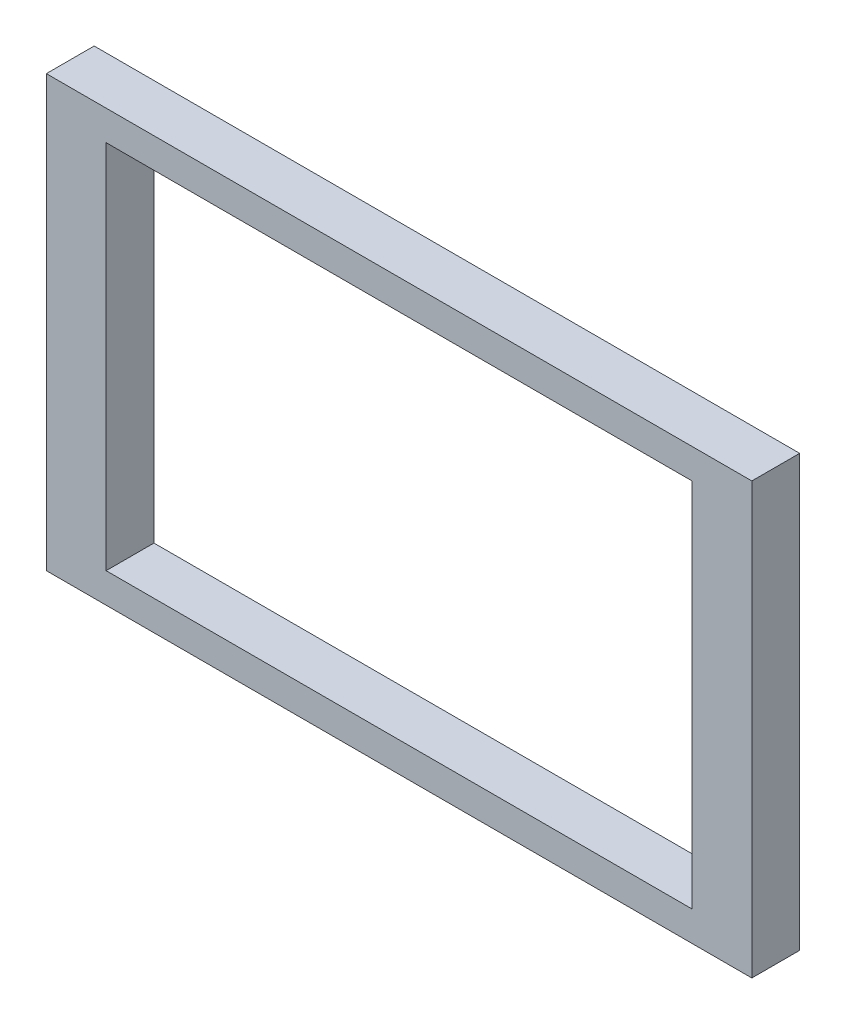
ISO-10303-21;
HEADER;
FILE_DESCRIPTION(('STEP AP214'),'2;1');
FILE_NAME('part.step','',(''),(''),'','','');
FILE_SCHEMA(('AUTOMOTIVE_DESIGN { 1 0 10303 214 1 1 1 1 }'));
ENDSEC;
DATA;
#1=APPLICATION_CONTEXT('core data for automotive mechanical design processes');
#2=APPLICATION_PROTOCOL_DEFINITION('international standard','automotive_design',2000,#1);
#3=PRODUCT_CONTEXT('',#1,'mechanical');
#4=PRODUCT('Part','Part','',(#3));
#5=PRODUCT_RELATED_PRODUCT_CATEGORY('part','',(#4));
#6=PRODUCT_DEFINITION_FORMATION('','',#4);
#7=PRODUCT_DEFINITION_CONTEXT('part definition',#1,'design');
#8=PRODUCT_DEFINITION('design','',#6,#7);
#9=PRODUCT_DEFINITION_SHAPE('','',#8);
#10=(LENGTH_UNIT() NAMED_UNIT(*) SI_UNIT(.MILLI.,.METRE.));
#11=(NAMED_UNIT(*) PLANE_ANGLE_UNIT() SI_UNIT($,.RADIAN.));
#12=(NAMED_UNIT(*) SI_UNIT($,.STERADIAN.) SOLID_ANGLE_UNIT());
#13=UNCERTAINTY_MEASURE_WITH_UNIT(LENGTH_MEASURE(1.E-05),#10,'distance_accuracy_value','');
#14=(GEOMETRIC_REPRESENTATION_CONTEXT(3) GLOBAL_UNCERTAINTY_ASSIGNED_CONTEXT((#13)) GLOBAL_UNIT_ASSIGNED_CONTEXT((#10,
#11,#12)) REPRESENTATION_CONTEXT('',''));
#15=CARTESIAN_POINT('',(0.,0.,0.));
#16=DIRECTION('',(0.,0.,1.));
#17=DIRECTION('',(1.,0.,0.));
#18=AXIS2_PLACEMENT_3D('',#15,#16,#17);
#19=CARTESIAN_POINT('',(0.,0.,4.));
#20=DIRECTION('',(1.,0.,0.));
#21=DIRECTION('',(0.,0.,-1.));
#22=AXIS2_PLACEMENT_3D('',#19,#20,#21);
#23=PLANE('',#22);
#24=DIRECTION('',(0.,-1.,0.));
#25=VECTOR('',#24,1.);
#26=CARTESIAN_POINT('',(0.,0.,0.));
#27=LINE('',#26,#25);
#28=CARTESIAN_POINT('',(0.,36.,0.));
#29=VERTEX_POINT('',#28);
#30=CARTESIAN_POINT('',(0.,0.,0.));
#31=VERTEX_POINT('',#30);
#32=EDGE_CURVE('E102',#29,#31,#27,.T.);
#33=ORIENTED_EDGE('',*,*,#32,.T.);
#34=DIRECTION('',(0.,0.,-1.));
#35=VECTOR('',#34,1.);
#36=CARTESIAN_POINT('',(0.,0.,4.));
#37=LINE('',#36,#35);
#38=CARTESIAN_POINT('',(0.,0.,4.));
#39=VERTEX_POINT('',#38);
#40=EDGE_CURVE('E11',#39,#31,#37,.T.);
#41=ORIENTED_EDGE('',*,*,#40,.F.);
#42=DIRECTION('',(0.,-1.,0.));
#43=VECTOR('',#42,1.);
#44=CARTESIAN_POINT('',(0.,0.,4.));
#45=LINE('',#44,#43);
#46=CARTESIAN_POINT('',(0.,36.,4.));
#47=VERTEX_POINT('',#46);
#48=EDGE_CURVE('E139',#47,#39,#45,.T.);
#49=ORIENTED_EDGE('',*,*,#48,.F.);
#50=DIRECTION('',(0.,0.,-1.));
#51=VECTOR('',#50,1.);
#52=CARTESIAN_POINT('',(0.,36.,4.));
#53=LINE('',#52,#51);
#54=EDGE_CURVE('E148',#47,#29,#53,.T.);
#55=ORIENTED_EDGE('',*,*,#54,.T.);
#56=EDGE_LOOP('',(#33,#41,#49,#55));
#57=FACE_BOUND('',#56,.T.);
#58=ADVANCED_FACE('F32',(#57),#23,.F.);
#59=CARTESIAN_POINT('',(0.,0.,4.));
#60=DIRECTION('',(0.,1.,0.));
#61=DIRECTION('',(0.,0.,1.));
#62=AXIS2_PLACEMENT_3D('',#59,#60,#61);
#63=PLANE('',#62);
#64=DIRECTION('',(1.,0.,0.));
#65=VECTOR('',#64,1.);
#66=CARTESIAN_POINT('',(0.,0.,0.));
#67=LINE('',#66,#65);
#68=CARTESIAN_POINT('',(59.,0.,0.));
#69=VERTEX_POINT('',#68);
#70=EDGE_CURVE('E133',#31,#69,#67,.T.);
#71=ORIENTED_EDGE('',*,*,#70,.T.);
#72=DIRECTION('',(0.,0.,-1.));
#73=VECTOR('',#72,1.);
#74=CARTESIAN_POINT('',(59.,0.,4.));
#75=LINE('',#74,#73);
#76=CARTESIAN_POINT('',(59.,0.,4.));
#77=VERTEX_POINT('',#76);
#78=EDGE_CURVE('E39',#77,#69,#75,.T.);
#79=ORIENTED_EDGE('',*,*,#78,.F.);
#80=DIRECTION('',(1.,0.,0.));
#81=VECTOR('',#80,1.);
#82=CARTESIAN_POINT('',(0.,0.,4.));
#83=LINE('',#82,#81);
#84=EDGE_CURVE('E142',#39,#77,#83,.T.);
#85=ORIENTED_EDGE('',*,*,#84,.F.);
#86=ORIENTED_EDGE('',*,*,#40,.T.);
#87=EDGE_LOOP('',(#71,#79,#85,#86));
#88=FACE_BOUND('',#87,.T.);
#89=ADVANCED_FACE('F172',(#88),#63,.F.);
#90=CARTESIAN_POINT('',(59.,0.,4.));
#91=DIRECTION('',(-1.,0.,0.));
#92=DIRECTION('',(0.,0.,1.));
#93=AXIS2_PLACEMENT_3D('',#90,#91,#92);
#94=PLANE('',#93);
#95=DIRECTION('',(0.,1.,0.));
#96=VECTOR('',#95,1.);
#97=CARTESIAN_POINT('',(59.,0.,0.));
#98=LINE('',#97,#96);
#99=CARTESIAN_POINT('',(59.,36.,0.));
#100=VERTEX_POINT('',#99);
#101=EDGE_CURVE('E135',#69,#100,#98,.T.);
#102=ORIENTED_EDGE('',*,*,#101,.T.);
#103=DIRECTION('',(0.,0.,-1.));
#104=VECTOR('',#103,1.);
#105=CARTESIAN_POINT('',(59.,36.,4.));
#106=LINE('',#105,#104);
#107=CARTESIAN_POINT('',(59.,36.,4.));
#108=VERTEX_POINT('',#107);
#109=EDGE_CURVE('E151',#108,#100,#106,.T.);
#110=ORIENTED_EDGE('',*,*,#109,.F.);
#111=DIRECTION('',(0.,1.,0.));
#112=VECTOR('',#111,1.);
#113=CARTESIAN_POINT('',(59.,0.,4.));
#114=LINE('',#113,#112);
#115=EDGE_CURVE('E144',#77,#108,#114,.T.);
#116=ORIENTED_EDGE('',*,*,#115,.F.);
#117=ORIENTED_EDGE('',*,*,#78,.T.);
#118=EDGE_LOOP('',(#102,#110,#116,#117));
#119=FACE_BOUND('',#118,.T.);
#120=ADVANCED_FACE('F158',(#119),#94,.F.);
#121=CARTESIAN_POINT('',(0.,36.,4.));
#122=DIRECTION('',(0.,-1.,0.));
#123=DIRECTION('',(0.,0.,-1.));
#124=AXIS2_PLACEMENT_3D('',#121,#122,#123);
#125=PLANE('',#124);
#126=DIRECTION('',(-1.,0.,0.));
#127=VECTOR('',#126,1.);
#128=CARTESIAN_POINT('',(0.,36.,0.));
#129=LINE('',#128,#127);
#130=EDGE_CURVE('E137',#100,#29,#129,.T.);
#131=ORIENTED_EDGE('',*,*,#130,.T.);
#132=ORIENTED_EDGE('',*,*,#54,.F.);
#133=DIRECTION('',(-1.,0.,0.));
#134=VECTOR('',#133,1.);
#135=CARTESIAN_POINT('',(0.,36.,4.));
#136=LINE('',#135,#134);
#137=EDGE_CURVE('E146',#108,#47,#136,.T.);
#138=ORIENTED_EDGE('',*,*,#137,.F.);
#139=ORIENTED_EDGE('',*,*,#109,.T.);
#140=EDGE_LOOP('',(#131,#132,#138,#139));
#141=FACE_BOUND('',#140,.T.);
#142=ADVANCED_FACE('F165',(#141),#125,.F.);
#143=CARTESIAN_POINT('',(0.,36.,4.));
#144=DIRECTION('',(0.,0.,-1.));
#145=DIRECTION('',(-1.,0.,0.));
#146=AXIS2_PLACEMENT_3D('',#143,#144,#145);
#147=PLANE('',#146);
#148=DIRECTION('',(1.,0.,0.));
#149=VECTOR('',#148,1.);
#150=CARTESIAN_POINT('',(5.,2.5,4.));
#151=LINE('',#150,#149);
#152=CARTESIAN_POINT('',(5.,2.5,4.));
#153=VERTEX_POINT('',#152);
#154=CARTESIAN_POINT('',(54.,2.5,4.));
#155=VERTEX_POINT('',#154);
#156=EDGE_CURVE('E115',#153,#155,#151,.T.);
#157=ORIENTED_EDGE('',*,*,#156,.F.);
#158=DIRECTION('',(0.,-1.,0.));
#159=VECTOR('',#158,1.);
#160=CARTESIAN_POINT('',(5.,33.5,4.));
#161=LINE('',#160,#159);
#162=CARTESIAN_POINT('',(5.,33.5,4.));
#163=VERTEX_POINT('',#162);
#164=EDGE_CURVE('E46',#163,#153,#161,.T.);
#165=ORIENTED_EDGE('',*,*,#164,.F.);
#166=DIRECTION('',(-1.,0.,0.));
#167=VECTOR('',#166,1.);
#168=CARTESIAN_POINT('',(5.,33.5,4.));
#169=LINE('',#168,#167);
#170=CARTESIAN_POINT('',(54.,33.5,4.));
#171=VERTEX_POINT('',#170);
#172=EDGE_CURVE('E108',#171,#163,#169,.T.);
#173=ORIENTED_EDGE('',*,*,#172,.F.);
#174=DIRECTION('',(0.,1.,0.));
#175=VECTOR('',#174,1.);
#176=CARTESIAN_POINT('',(54.,33.5,4.));
#177=LINE('',#176,#175);
#178=EDGE_CURVE('E122',#155,#171,#177,.T.);
#179=ORIENTED_EDGE('',*,*,#178,.F.);
#180=EDGE_LOOP('',(#157,#165,#173,#179));
#181=FACE_BOUND('',#180,.T.);
#182=ORIENTED_EDGE('',*,*,#48,.T.);
#183=ORIENTED_EDGE('',*,*,#84,.T.);
#184=ORIENTED_EDGE('',*,*,#115,.T.);
#185=ORIENTED_EDGE('',*,*,#137,.T.);
#186=EDGE_LOOP('',(#182,#183,#184,#185));
#187=FACE_BOUND('',#186,.T.);
#188=ADVANCED_FACE('F171',(#181,#187),#147,.F.);
#189=CARTESIAN_POINT('',(0.,36.,0.));
#190=DIRECTION('',(0.,0.,-1.));
#191=DIRECTION('',(-1.,0.,0.));
#192=AXIS2_PLACEMENT_3D('',#189,#190,#191);
#193=PLANE('',#192);
#194=DIRECTION('',(0.,-1.,0.));
#195=VECTOR('',#194,1.);
#196=CARTESIAN_POINT('',(5.,33.5,0.));
#197=LINE('',#196,#195);
#198=CARTESIAN_POINT('',(5.,33.5,0.));
#199=VERTEX_POINT('',#198);
#200=CARTESIAN_POINT('',(5.,2.5,0.));
#201=VERTEX_POINT('',#200);
#202=EDGE_CURVE('E106',#199,#201,#197,.T.);
#203=ORIENTED_EDGE('',*,*,#202,.T.);
#204=DIRECTION('',(1.,0.,0.));
#205=VECTOR('',#204,1.);
#206=CARTESIAN_POINT('',(5.,2.5,0.));
#207=LINE('',#206,#205);
#208=CARTESIAN_POINT('',(54.,2.5,0.));
#209=VERTEX_POINT('',#208);
#210=EDGE_CURVE('E95',#201,#209,#207,.T.);
#211=ORIENTED_EDGE('',*,*,#210,.T.);
#212=DIRECTION('',(0.,1.,0.));
#213=VECTOR('',#212,1.);
#214=CARTESIAN_POINT('',(54.,33.5,0.));
#215=LINE('',#214,#213);
#216=CARTESIAN_POINT('',(54.,33.5,0.));
#217=VERTEX_POINT('',#216);
#218=EDGE_CURVE('E117',#209,#217,#215,.T.);
#219=ORIENTED_EDGE('',*,*,#218,.T.);
#220=DIRECTION('',(-1.,0.,0.));
#221=VECTOR('',#220,1.);
#222=CARTESIAN_POINT('',(5.,33.5,0.));
#223=LINE('',#222,#221);
#224=EDGE_CURVE('E113',#217,#199,#223,.T.);
#225=ORIENTED_EDGE('',*,*,#224,.T.);
#226=EDGE_LOOP('',(#203,#211,#219,#225));
#227=FACE_BOUND('',#226,.T.);
#228=ORIENTED_EDGE('',*,*,#32,.F.);
#229=ORIENTED_EDGE('',*,*,#130,.F.);
#230=ORIENTED_EDGE('',*,*,#101,.F.);
#231=ORIENTED_EDGE('',*,*,#70,.F.);
#232=EDGE_LOOP('',(#228,#229,#230,#231));
#233=FACE_BOUND('',#232,.T.);
#234=ADVANCED_FACE('F111',(#227,#233),#193,.T.);
#235=CARTESIAN_POINT('',(5.,33.5,-0.00100000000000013));
#236=DIRECTION('',(-1.,0.,0.));
#237=DIRECTION('',(0.,0.,1.));
#238=AXIS2_PLACEMENT_3D('',#235,#236,#237);
#239=PLANE('',#238);
#240=DIRECTION('',(0.,0.,1.));
#241=VECTOR('',#240,1.);
#242=CARTESIAN_POINT('',(5.,33.5,-0.00100000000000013));
#243=LINE('',#242,#241);
#244=EDGE_CURVE('E103',#199,#163,#243,.T.);
#245=ORIENTED_EDGE('',*,*,#244,.T.);
#246=ORIENTED_EDGE('',*,*,#164,.T.);
#247=DIRECTION('',(0.,0.,1.));
#248=VECTOR('',#247,1.);
#249=CARTESIAN_POINT('',(5.,2.5,-0.00100000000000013));
#250=LINE('',#249,#248);
#251=EDGE_CURVE('E97',#201,#153,#250,.T.);
#252=ORIENTED_EDGE('',*,*,#251,.F.);
#253=ORIENTED_EDGE('',*,*,#202,.F.);
#254=EDGE_LOOP('',(#245,#246,#252,#253));
#255=FACE_BOUND('',#254,.T.);
#256=ADVANCED_FACE('F105',(#255),#239,.F.);
#257=CARTESIAN_POINT('',(5.,33.5,-0.00100000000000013));
#258=DIRECTION('',(0.,1.,0.));
#259=DIRECTION('',(0.,0.,1.));
#260=AXIS2_PLACEMENT_3D('',#257,#258,#259);
#261=PLANE('',#260);
#262=DIRECTION('',(0.,0.,1.));
#263=VECTOR('',#262,1.);
#264=CARTESIAN_POINT('',(54.,33.5,-0.00100000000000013));
#265=LINE('',#264,#263);
#266=EDGE_CURVE('E128',#217,#171,#265,.T.);
#267=ORIENTED_EDGE('',*,*,#266,.T.);
#268=ORIENTED_EDGE('',*,*,#172,.T.);
#269=ORIENTED_EDGE('',*,*,#244,.F.);
#270=ORIENTED_EDGE('',*,*,#224,.F.);
#271=EDGE_LOOP('',(#267,#268,#269,#270));
#272=FACE_BOUND('',#271,.T.);
#273=ADVANCED_FACE('F189',(#272),#261,.F.);
#274=CARTESIAN_POINT('',(54.,33.5,-0.00100000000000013));
#275=DIRECTION('',(1.,0.,0.));
#276=DIRECTION('',(0.,0.,-1.));
#277=AXIS2_PLACEMENT_3D('',#274,#275,#276);
#278=PLANE('',#277);
#279=DIRECTION('',(0.,0.,1.));
#280=VECTOR('',#279,1.);
#281=CARTESIAN_POINT('',(54.,2.5,-0.00100000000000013));
#282=LINE('',#281,#280);
#283=EDGE_CURVE('E54',#209,#155,#282,.T.);
#284=ORIENTED_EDGE('',*,*,#283,.T.);
#285=ORIENTED_EDGE('',*,*,#178,.T.);
#286=ORIENTED_EDGE('',*,*,#266,.F.);
#287=ORIENTED_EDGE('',*,*,#218,.F.);
#288=EDGE_LOOP('',(#284,#285,#286,#287));
#289=FACE_BOUND('',#288,.T.);
#290=ADVANCED_FACE('F192',(#289),#278,.F.);
#291=CARTESIAN_POINT('',(5.,2.5,-0.00100000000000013));
#292=DIRECTION('',(0.,-1.,0.));
#293=DIRECTION('',(0.,0.,-1.));
#294=AXIS2_PLACEMENT_3D('',#291,#292,#293);
#295=PLANE('',#294);
#296=ORIENTED_EDGE('',*,*,#251,.T.);
#297=ORIENTED_EDGE('',*,*,#156,.T.);
#298=ORIENTED_EDGE('',*,*,#283,.F.);
#299=ORIENTED_EDGE('',*,*,#210,.F.);
#300=EDGE_LOOP('',(#296,#297,#298,#299));
#301=FACE_BOUND('',#300,.T.);
#302=ADVANCED_FACE('F96',(#301),#295,.F.);
#303=CLOSED_SHELL('',(#58,#89,#120,#142,#188,#234,#256,#273,#290,#302));
#304=MANIFOLD_SOLID_BREP('B2',#303);
#305=ADVANCED_BREP_SHAPE_REPRESENTATION('',(#18,#304),#14);
#306=SHAPE_DEFINITION_REPRESENTATION(#9,#305);
ENDSEC;
END-ISO-10303-21;
